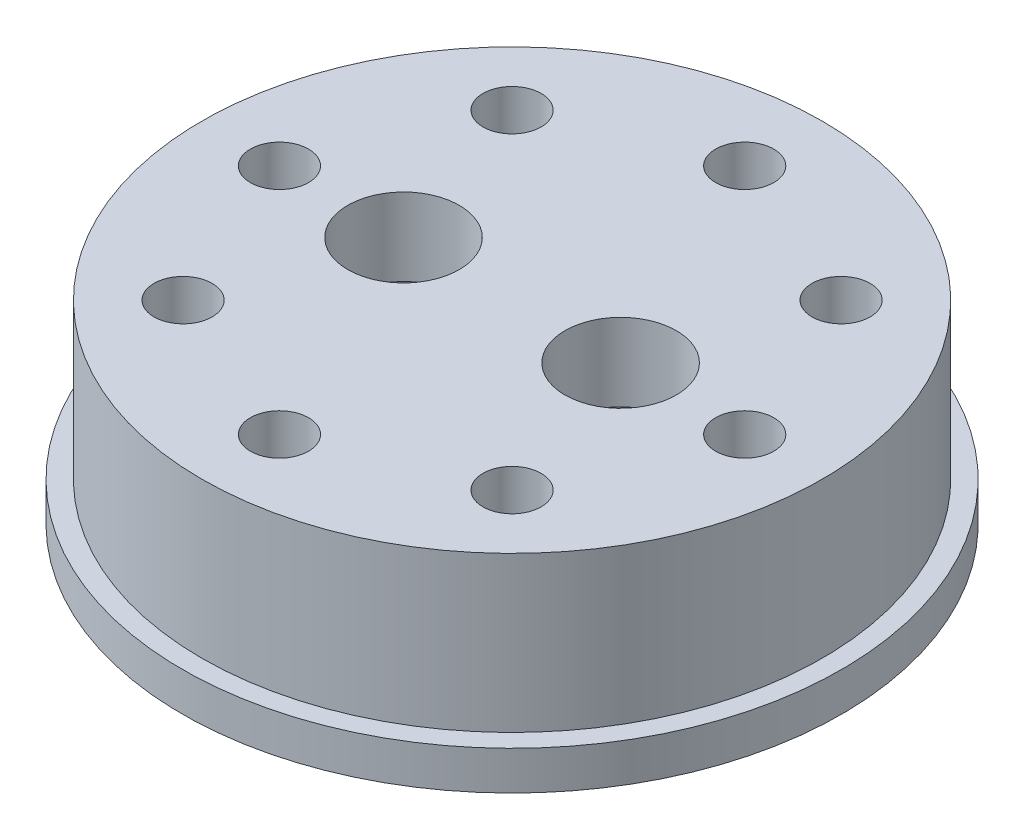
from build123d import *

# Parameters (mm, degrees)
SKETCH1_R                        = 50.8
SKETCH1_R_2                      = 30.48
SKETCH1_R_3                      = 4.7625
BOSS_EXTRUDE1_DEPTH              = 31.75
BOSS_EXTRUDE2_START              = -31.75
BOSS_EXTRUDE2_DEPTH              = 31.75
FILLET1_R                        = 5.08
SKETCH3_R                        = 53.975
SKETCH3_R_2                      = 45.002562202
BOSS_EXTRUDE3_DEPTH              = 6.35
SKETCH4_R                        = 32.484824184
BOSS_EXTRUDE4_DEPTH              = 12.7
F_23_32_0_71875_DIAMETER_HOLE1_D = 18.25625


with BuildPart() as part:
    # Sketch1 → Boss-Extrude1 (new body)
    with BuildSketch(Plane(origin=(0, 0, 0), x_dir=(1, 0, 0), z_dir=(0, 1, 0))):
        with Locations(Location((0, 0, 0), (0, 0, 270))):
            Circle(SKETCH1_R)
        with Locations(Location((0, 0, 0), (0, 0, 270))):
            Circle(SKETCH1_R_2, mode=Mode.SUBTRACT)
        with Locations(Location((0, 38.1, 0), (0, 0, 270))):
            Circle(SKETCH1_R_3, mode=Mode.SUBTRACT)
        with Locations(Location((26.940768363, 26.940768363, 0), (0, 0, 270))):
            Circle(SKETCH1_R_3, mode=Mode.SUBTRACT)
        with Locations(Location((38.1, 0, 0), (0, 0, 270))):
            Circle(SKETCH1_R_3, mode=Mode.SUBTRACT)
        with Locations(Location((26.940768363, -26.940768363, 0), (0, 0, 270))):
            Circle(SKETCH1_R_3, mode=Mode.SUBTRACT)
        with Locations(Location((0, -38.1, 0), (0, 0, 270))):
            Circle(SKETCH1_R_3, mode=Mode.SUBTRACT)
        with Locations(Location((-26.940768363, -26.940768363, 0), (0, 0, 270))):
            Circle(SKETCH1_R_3, mode=Mode.SUBTRACT)
        with Locations(Location((-38.1, 0, 0), (0, 0, 270))):
            Circle(SKETCH1_R_3, mode=Mode.SUBTRACT)
        with Locations(Location((-26.940768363, 26.940768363, 0), (0, 0, 270))):
            Circle(SKETCH1_R_3, mode=Mode.SUBTRACT)
    extrude(amount=BOSS_EXTRUDE1_DEPTH)

    # Sketch2 → Boss-Extrude2 (add)
    with BuildSketch(Plane(origin=(0, 31.75, 0), x_dir=(1, 0, 0), z_dir=(0, 1, 0)).offset(BOSS_EXTRUDE2_START)):
        with BuildLine():
            ThreePointArc((-3.175, -30.314184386), (0, -30.48), (3.175, -30.314184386))
            Line((3.175, -30.314184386), (3.175, 30.314184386))
            ThreePointArc((3.175, 30.314184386), (0, 30.48), (-3.175, 30.314184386))
            Line((-3.175, 30.314184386), (-3.175, -30.314184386))
        make_face()
    extrude(amount=BOSS_EXTRUDE2_DEPTH)

    # Fillet1
    fillet1_edges = [part.edges().sort_by_distance(p)[0] for p in [
        (3.175, 15.875, -30.314184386),
        (-3.175, 15.875, -30.314184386),
        (3.175, 15.875, 30.314184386),
        (-3.175, 15.875, 30.314184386),
    ]]
    fillet(fillet1_edges, radius=FILLET1_R)

    # Sketch3 → Boss-Extrude3 (add)
    with BuildSketch(Plane(origin=(0, 0, 0), x_dir=(-1, 0, 0), z_dir=(0, -1, 0))):
        with Locations(Location((0, 0, 0), (0, 0, 90))):
            Circle(SKETCH3_R)
        Circle(SKETCH3_R_2, mode=Mode.SUBTRACT)
    extrude(amount=-BOSS_EXTRUDE3_DEPTH)

    # Sketch4 → Boss-Extrude4 (add)
    with BuildSketch(Plane(origin=(0, 31.75, 0), x_dir=(1, 0, 0), z_dir=(0, 1, 0))):
        Circle(SKETCH4_R)
    extrude(amount=-BOSS_EXTRUDE4_DEPTH)

    # 23_32 _0.71875_ Diameter Hole1 (through all)
    with Locations(Plane(origin=(0, 31.75, 0), x_dir=(1, 0, 0), z_dir=(0, 1, 0))):
        with Locations((-17.78, 0), (17.78, 0)):
            Hole(F_23_32_0_71875_DIAMETER_HOLE1_D / 2)


solid = part.part
